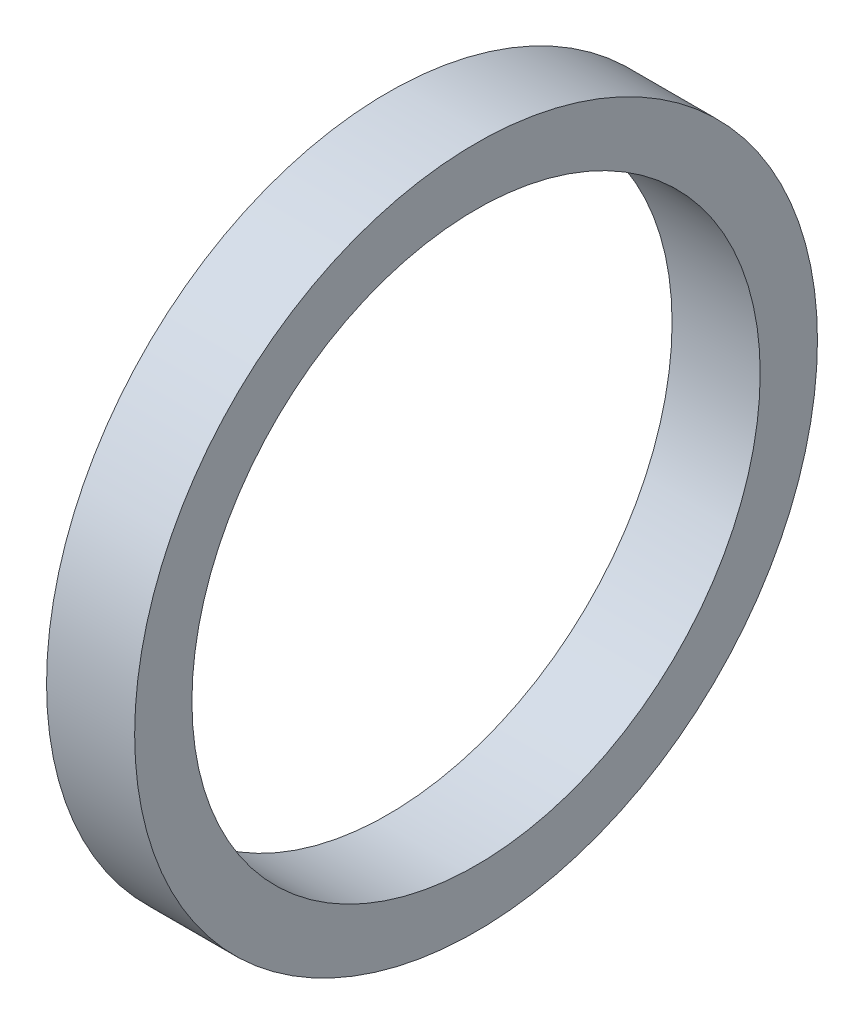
ISO-10303-21;
HEADER;
FILE_DESCRIPTION(('STEP AP214'),'2;1');
FILE_NAME('part.step','',(''),(''),'','','');
FILE_SCHEMA(('AUTOMOTIVE_DESIGN { 1 0 10303 214 1 1 1 1 }'));
ENDSEC;
DATA;
#1=APPLICATION_CONTEXT('core data for automotive mechanical design processes');
#2=APPLICATION_PROTOCOL_DEFINITION('international standard','automotive_design',2000,#1);
#3=PRODUCT_CONTEXT('',#1,'mechanical');
#4=PRODUCT('Part','Part','',(#3));
#5=PRODUCT_RELATED_PRODUCT_CATEGORY('part','',(#4));
#6=PRODUCT_DEFINITION_FORMATION('','',#4);
#7=PRODUCT_DEFINITION_CONTEXT('part definition',#1,'design');
#8=PRODUCT_DEFINITION('design','',#6,#7);
#9=PRODUCT_DEFINITION_SHAPE('','',#8);
#10=(LENGTH_UNIT() NAMED_UNIT(*) SI_UNIT(.MILLI.,.METRE.));
#11=(NAMED_UNIT(*) PLANE_ANGLE_UNIT() SI_UNIT($,.RADIAN.));
#12=(NAMED_UNIT(*) SI_UNIT($,.STERADIAN.) SOLID_ANGLE_UNIT());
#13=UNCERTAINTY_MEASURE_WITH_UNIT(LENGTH_MEASURE(1.E-05),#10,'distance_accuracy_value','');
#14=(GEOMETRIC_REPRESENTATION_CONTEXT(3) GLOBAL_UNCERTAINTY_ASSIGNED_CONTEXT((#13)) GLOBAL_UNIT_ASSIGNED_CONTEXT((#10,
#11,#12)) REPRESENTATION_CONTEXT('',''));
#15=CARTESIAN_POINT('',(0.,0.,0.));
#16=DIRECTION('',(0.,0.,1.));
#17=DIRECTION('',(1.,0.,0.));
#18=AXIS2_PLACEMENT_3D('',#15,#16,#17);
#19=CARTESIAN_POINT('',(0.,15.5,0.));
#20=DIRECTION('',(1.,0.,0.));
#21=DIRECTION('',(0.,0.,-1.));
#22=AXIS2_PLACEMENT_3D('',#19,#20,#21);
#23=PLANE('',#22);
#24=CARTESIAN_POINT('',(0.,0.,0.));
#25=DIRECTION('',(-1.,0.,0.));
#26=DIRECTION('',(0.,0.,1.));
#27=AXIS2_PLACEMENT_3D('',#24,#25,#26);
#28=CIRCLE('',#27,12.9);
#29=CARTESIAN_POINT('',(0.,0.,12.9));
#30=VERTEX_POINT('',#29);
#31=EDGE_CURVE('E10',#30,#30,#28,.T.);
#32=ORIENTED_EDGE('',*,*,#31,.F.);
#33=EDGE_LOOP('',(#32));
#34=FACE_BOUND('',#33,.T.);
#35=CARTESIAN_POINT('',(0.,0.,0.));
#36=DIRECTION('',(-1.,0.,0.));
#37=DIRECTION('',(0.,0.,1.));
#38=AXIS2_PLACEMENT_3D('',#35,#36,#37);
#39=CIRCLE('',#38,15.5);
#40=CARTESIAN_POINT('',(0.,0.,15.5));
#41=VERTEX_POINT('',#40);
#42=EDGE_CURVE('E44',#41,#41,#39,.T.);
#43=ORIENTED_EDGE('',*,*,#42,.T.);
#44=EDGE_LOOP('',(#43));
#45=FACE_BOUND('',#44,.T.);
#46=ADVANCED_FACE('F30',(#34,#45),#23,.F.);
#47=CARTESIAN_POINT('',(-17.35844587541,0.,0.));
#48=DIRECTION('',(-1.,0.,0.));
#49=DIRECTION('',(0.,0.,1.));
#50=AXIS2_PLACEMENT_3D('',#47,#48,#49);
#51=CYLINDRICAL_SURFACE('',#50,12.9);
#52=CARTESIAN_POINT('',(4.,0.,0.));
#53=DIRECTION('',(-1.,0.,0.));
#54=DIRECTION('',(0.,0.,1.));
#55=AXIS2_PLACEMENT_3D('',#52,#53,#54);
#56=CIRCLE('',#55,12.9);
#57=CARTESIAN_POINT('',(4.,0.,12.9));
#58=VERTEX_POINT('',#57);
#59=EDGE_CURVE('E36',#58,#58,#56,.T.);
#60=ORIENTED_EDGE('',*,*,#59,.F.);
#61=EDGE_LOOP('',(#60));
#62=FACE_BOUND('',#61,.T.);
#63=ORIENTED_EDGE('',*,*,#31,.T.);
#64=EDGE_LOOP('',(#63));
#65=FACE_BOUND('',#64,.T.);
#66=ADVANCED_FACE('F59',(#62,#65),#51,.F.);
#67=CARTESIAN_POINT('',(4.,15.5,0.));
#68=DIRECTION('',(-1.,0.,0.));
#69=DIRECTION('',(0.,0.,1.));
#70=AXIS2_PLACEMENT_3D('',#67,#68,#69);
#71=PLANE('',#70);
#72=CARTESIAN_POINT('',(4.,0.,0.));
#73=DIRECTION('',(-1.,0.,0.));
#74=DIRECTION('',(0.,0.,1.));
#75=AXIS2_PLACEMENT_3D('',#72,#73,#74);
#76=CIRCLE('',#75,15.5);
#77=CARTESIAN_POINT('',(4.,0.,15.5));
#78=VERTEX_POINT('',#77);
#79=EDGE_CURVE('E40',#78,#78,#76,.T.);
#80=ORIENTED_EDGE('',*,*,#79,.F.);
#81=EDGE_LOOP('',(#80));
#82=FACE_BOUND('',#81,.T.);
#83=ORIENTED_EDGE('',*,*,#59,.T.);
#84=EDGE_LOOP('',(#83));
#85=FACE_BOUND('',#84,.T.);
#86=ADVANCED_FACE('F54',(#82,#85),#71,.F.);
#87=CARTESIAN_POINT('',(-17.35844587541,0.,0.));
#88=DIRECTION('',(-1.,0.,0.));
#89=DIRECTION('',(0.,0.,1.));
#90=AXIS2_PLACEMENT_3D('',#87,#88,#89);
#91=CYLINDRICAL_SURFACE('',#90,15.5);
#92=ORIENTED_EDGE('',*,*,#42,.F.);
#93=EDGE_LOOP('',(#92));
#94=FACE_BOUND('',#93,.T.);
#95=ORIENTED_EDGE('',*,*,#79,.T.);
#96=EDGE_LOOP('',(#95));
#97=FACE_BOUND('',#96,.T.);
#98=ADVANCED_FACE('F51',(#94,#97),#91,.T.);
#99=CLOSED_SHELL('',(#46,#66,#86,#98));
#100=MANIFOLD_SOLID_BREP('B2',#99);
#101=ADVANCED_BREP_SHAPE_REPRESENTATION('',(#18,#100),#14);
#102=SHAPE_DEFINITION_REPRESENTATION(#9,#101);
ENDSEC;
END-ISO-10303-21;
